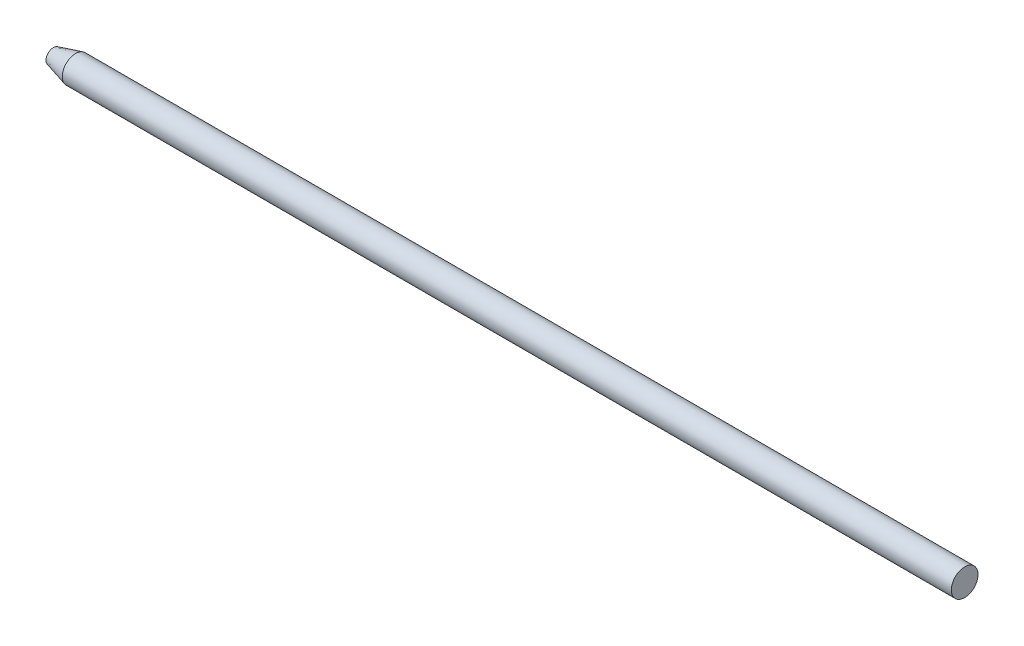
ISO-10303-21;
HEADER;
FILE_DESCRIPTION(('STEP AP214'),'2;1');
FILE_NAME('part.step','',(''),(''),'','','');
FILE_SCHEMA(('AUTOMOTIVE_DESIGN { 1 0 10303 214 1 1 1 1 }'));
ENDSEC;
DATA;
#1=APPLICATION_CONTEXT('core data for automotive mechanical design processes');
#2=APPLICATION_PROTOCOL_DEFINITION('international standard','automotive_design',2000,#1);
#3=PRODUCT_CONTEXT('',#1,'mechanical');
#4=PRODUCT('Part','Part','',(#3));
#5=PRODUCT_RELATED_PRODUCT_CATEGORY('part','',(#4));
#6=PRODUCT_DEFINITION_FORMATION('','',#4);
#7=PRODUCT_DEFINITION_CONTEXT('part definition',#1,'design');
#8=PRODUCT_DEFINITION('design','',#6,#7);
#9=PRODUCT_DEFINITION_SHAPE('','',#8);
#10=(LENGTH_UNIT() NAMED_UNIT(*) SI_UNIT(.MILLI.,.METRE.));
#11=(NAMED_UNIT(*) PLANE_ANGLE_UNIT() SI_UNIT($,.RADIAN.));
#12=(NAMED_UNIT(*) SI_UNIT($,.STERADIAN.) SOLID_ANGLE_UNIT());
#13=UNCERTAINTY_MEASURE_WITH_UNIT(LENGTH_MEASURE(1.E-05),#10,'distance_accuracy_value','');
#14=(GEOMETRIC_REPRESENTATION_CONTEXT(3) GLOBAL_UNCERTAINTY_ASSIGNED_CONTEXT((#13)) GLOBAL_UNIT_ASSIGNED_CONTEXT((#10,
#11,#12)) REPRESENTATION_CONTEXT('',''));
#15=CARTESIAN_POINT('',(0.,0.,0.));
#16=DIRECTION('',(0.,0.,1.));
#17=DIRECTION('',(1.,0.,0.));
#18=AXIS2_PLACEMENT_3D('',#15,#16,#17);
#19=CARTESIAN_POINT('',(0.,0.,0.));
#20=DIRECTION('',(1.,0.,0.));
#21=DIRECTION('',(0.,0.,-1.));
#22=AXIS2_PLACEMENT_3D('',#19,#20,#21);
#23=PLANE('',#22);
#24=CARTESIAN_POINT('',(0.,0.,0.));
#25=DIRECTION('',(-1.,0.,0.));
#26=DIRECTION('',(0.,0.,1.));
#27=AXIS2_PLACEMENT_3D('',#24,#25,#26);
#28=CIRCLE('',#27,1.66025403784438);
#29=CARTESIAN_POINT('',(0.,0.,1.66025403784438));
#30=VERTEX_POINT('',#29);
#31=EDGE_CURVE('E10',#30,#30,#28,.T.);
#32=ORIENTED_EDGE('',*,*,#31,.T.);
#33=EDGE_LOOP('',(#32));
#34=FACE_BOUND('',#33,.T.);
#35=ADVANCED_FACE('F34',(#34),#23,.F.);
#36=CARTESIAN_POINT('',(5.,0.,0.));
#37=DIRECTION('',(1.,0.,0.));
#38=DIRECTION('',(0.,0.,-1.));
#39=AXIS2_PLACEMENT_3D('',#36,#37,#38);
#40=CONICAL_SURFACE('',#39,3.,0.26179938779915);
#41=ORIENTED_EDGE('',*,*,#31,.F.);
#42=EDGE_LOOP('',(#41));
#43=FACE_BOUND('',#42,.T.);
#44=CARTESIAN_POINT('',(5.,0.,0.));
#45=DIRECTION('',(-1.,0.,0.));
#46=DIRECTION('',(0.,0.,1.));
#47=AXIS2_PLACEMENT_3D('',#44,#45,#46);
#48=CIRCLE('',#47,3.);
#49=CARTESIAN_POINT('',(5.,0.,3.));
#50=VERTEX_POINT('',#49);
#51=EDGE_CURVE('E40',#50,#50,#48,.T.);
#52=ORIENTED_EDGE('',*,*,#51,.T.);
#53=EDGE_LOOP('',(#52));
#54=FACE_BOUND('',#53,.T.);
#55=ADVANCED_FACE('F59',(#43,#54),#40,.T.);
#56=CARTESIAN_POINT('',(0.,0.,0.));
#57=DIRECTION('',(-1.,0.,0.));
#58=DIRECTION('',(0.,0.,1.));
#59=AXIS2_PLACEMENT_3D('',#56,#57,#58);
#60=CYLINDRICAL_SURFACE('',#59,3.);
#61=ORIENTED_EDGE('',*,*,#51,.F.);
#62=EDGE_LOOP('',(#61));
#63=FACE_BOUND('',#62,.T.);
#64=CARTESIAN_POINT('',(205.,0.,0.));
#65=DIRECTION('',(-1.,0.,0.));
#66=DIRECTION('',(0.,0.,1.));
#67=AXIS2_PLACEMENT_3D('',#64,#65,#66);
#68=CIRCLE('',#67,3.);
#69=CARTESIAN_POINT('',(205.,0.,3.));
#70=VERTEX_POINT('',#69);
#71=EDGE_CURVE('E44',#70,#70,#68,.T.);
#72=ORIENTED_EDGE('',*,*,#71,.T.);
#73=EDGE_LOOP('',(#72));
#74=FACE_BOUND('',#73,.T.);
#75=ADVANCED_FACE('F51',(#63,#74),#60,.T.);
#76=CARTESIAN_POINT('',(205.,3.,0.));
#77=DIRECTION('',(-1.,0.,0.));
#78=DIRECTION('',(0.,0.,1.));
#79=AXIS2_PLACEMENT_3D('',#76,#77,#78);
#80=PLANE('',#79);
#81=ORIENTED_EDGE('',*,*,#71,.F.);
#82=EDGE_LOOP('',(#81));
#83=FACE_BOUND('',#82,.T.);
#84=ADVANCED_FACE('F53',(#83),#80,.F.);
#85=CLOSED_SHELL('',(#35,#55,#75,#84));
#86=MANIFOLD_SOLID_BREP('B2',#85);
#87=ADVANCED_BREP_SHAPE_REPRESENTATION('',(#18,#86),#14);
#88=SHAPE_DEFINITION_REPRESENTATION(#9,#87);
ENDSEC;
END-ISO-10303-21;
